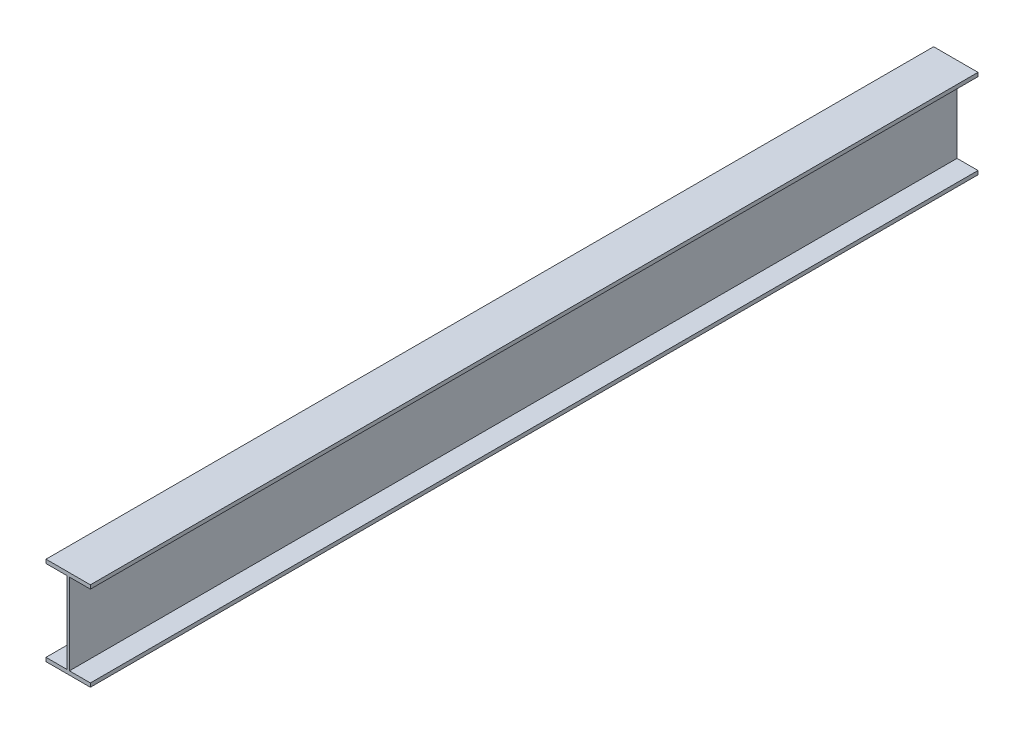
ISO-10303-21;
HEADER;
FILE_DESCRIPTION(('STEP AP214'),'2;1');
FILE_NAME('part.step','',(''),(''),'','','');
FILE_SCHEMA(('AUTOMOTIVE_DESIGN { 1 0 10303 214 1 1 1 1 }'));
ENDSEC;
DATA;
#1=APPLICATION_CONTEXT('core data for automotive mechanical design processes');
#2=APPLICATION_PROTOCOL_DEFINITION('international standard','automotive_design',2000,#1);
#3=PRODUCT_CONTEXT('',#1,'mechanical');
#4=PRODUCT('Part','Part','',(#3));
#5=PRODUCT_RELATED_PRODUCT_CATEGORY('part','',(#4));
#6=PRODUCT_DEFINITION_FORMATION('','',#4);
#7=PRODUCT_DEFINITION_CONTEXT('part definition',#1,'design');
#8=PRODUCT_DEFINITION('design','',#6,#7);
#9=PRODUCT_DEFINITION_SHAPE('','',#8);
#10=(LENGTH_UNIT() NAMED_UNIT(*) SI_UNIT(.MILLI.,.METRE.));
#11=(NAMED_UNIT(*) PLANE_ANGLE_UNIT() SI_UNIT($,.RADIAN.));
#12=(NAMED_UNIT(*) SI_UNIT($,.STERADIAN.) SOLID_ANGLE_UNIT());
#13=UNCERTAINTY_MEASURE_WITH_UNIT(LENGTH_MEASURE(1.E-05),#10,'distance_accuracy_value','');
#14=(GEOMETRIC_REPRESENTATION_CONTEXT(3) GLOBAL_UNCERTAINTY_ASSIGNED_CONTEXT((#13)) GLOBAL_UNIT_ASSIGNED_CONTEXT((#10,
#11,#12)) REPRESENTATION_CONTEXT('',''));
#15=CARTESIAN_POINT('',(0.,0.,0.));
#16=DIRECTION('',(0.,0.,1.));
#17=DIRECTION('',(1.,0.,0.));
#18=AXIS2_PLACEMENT_3D('',#15,#16,#17);
#19=CARTESIAN_POINT('',(0.,0.,2000.));
#20=DIRECTION('',(0.,0.,1.));
#21=DIRECTION('',(1.,0.,0.));
#22=AXIS2_PLACEMENT_3D('',#19,#20,#21);
#23=PLANE('',#22);
#24=DIRECTION('',(1.,0.,0.));
#25=VECTOR('',#24,1.);
#26=CARTESIAN_POINT('',(-50.,-100.,2000.));
#27=LINE('',#26,#25);
#28=CARTESIAN_POINT('',(-50.,-100.,2000.));
#29=VERTEX_POINT('',#28);
#30=CARTESIAN_POINT('',(50.,-100.,2000.));
#31=VERTEX_POINT('',#30);
#32=EDGE_CURVE('E271',#29,#31,#27,.T.);
#33=ORIENTED_EDGE('',*,*,#32,.T.);
#34=DIRECTION('',(0.,1.,0.));
#35=VECTOR('',#34,1.);
#36=CARTESIAN_POINT('',(50.,-100.,2000.));
#37=LINE('',#36,#35);
#38=CARTESIAN_POINT('',(50.,-91.5,2000.));
#39=VERTEX_POINT('',#38);
#40=EDGE_CURVE('E251',#31,#39,#37,.T.);
#41=ORIENTED_EDGE('',*,*,#40,.T.);
#42=DIRECTION('',(-1.,0.,0.));
#43=VECTOR('',#42,1.);
#44=CARTESIAN_POINT('',(50.,-91.5,2000.));
#45=LINE('',#44,#43);
#46=CARTESIAN_POINT('',(2.8,-91.5,2000.));
#47=VERTEX_POINT('',#46);
#48=EDGE_CURVE('E159',#39,#47,#45,.T.);
#49=ORIENTED_EDGE('',*,*,#48,.T.);
#50=DIRECTION('',(0.,1.,0.));
#51=VECTOR('',#50,1.);
#52=CARTESIAN_POINT('',(2.8,-91.5,2000.));
#53=LINE('',#52,#51);
#54=CARTESIAN_POINT('',(2.8,91.5,2000.));
#55=VERTEX_POINT('',#54);
#56=EDGE_CURVE('E230',#47,#55,#53,.T.);
#57=ORIENTED_EDGE('',*,*,#56,.T.);
#58=DIRECTION('',(1.,0.,0.));
#59=VECTOR('',#58,1.);
#60=CARTESIAN_POINT('',(2.8,91.5,2000.));
#61=LINE('',#60,#59);
#62=CARTESIAN_POINT('',(50.,91.5,2000.));
#63=VERTEX_POINT('',#62);
#64=EDGE_CURVE('E172',#55,#63,#61,.T.);
#65=ORIENTED_EDGE('',*,*,#64,.T.);
#66=DIRECTION('',(0.,1.,0.));
#67=VECTOR('',#66,1.);
#68=CARTESIAN_POINT('',(50.,91.5,2000.));
#69=LINE('',#68,#67);
#70=CARTESIAN_POINT('',(50.,100.,2000.));
#71=VERTEX_POINT('',#70);
#72=EDGE_CURVE('E176',#63,#71,#69,.T.);
#73=ORIENTED_EDGE('',*,*,#72,.T.);
#74=DIRECTION('',(-1.,0.,0.));
#75=VECTOR('',#74,1.);
#76=CARTESIAN_POINT('',(50.,100.,2000.));
#77=LINE('',#76,#75);
#78=CARTESIAN_POINT('',(-50.,100.,2000.));
#79=VERTEX_POINT('',#78);
#80=EDGE_CURVE('E185',#71,#79,#77,.T.);
#81=ORIENTED_EDGE('',*,*,#80,.T.);
#82=DIRECTION('',(0.,-1.,0.));
#83=VECTOR('',#82,1.);
#84=CARTESIAN_POINT('',(-50.,100.,2000.));
#85=LINE('',#84,#83);
#86=CARTESIAN_POINT('',(-50.,91.5,2000.));
#87=VERTEX_POINT('',#86);
#88=EDGE_CURVE('E197',#79,#87,#85,.T.);
#89=ORIENTED_EDGE('',*,*,#88,.T.);
#90=DIRECTION('',(1.,0.,0.));
#91=VECTOR('',#90,1.);
#92=CARTESIAN_POINT('',(-50.,91.5,2000.));
#93=LINE('',#92,#91);
#94=CARTESIAN_POINT('',(-2.8,91.5,2000.));
#95=VERTEX_POINT('',#94);
#96=EDGE_CURVE('E139',#87,#95,#93,.T.);
#97=ORIENTED_EDGE('',*,*,#96,.T.);
#98=DIRECTION('',(0.,-1.,0.));
#99=VECTOR('',#98,1.);
#100=CARTESIAN_POINT('',(-2.8,91.5,2000.));
#101=LINE('',#100,#99);
#102=CARTESIAN_POINT('',(-2.8,-91.5,2000.));
#103=VERTEX_POINT('',#102);
#104=EDGE_CURVE('E124',#95,#103,#101,.T.);
#105=ORIENTED_EDGE('',*,*,#104,.T.);
#106=DIRECTION('',(-1.,0.,0.));
#107=VECTOR('',#106,1.);
#108=CARTESIAN_POINT('',(-2.8,-91.5,2000.));
#109=LINE('',#108,#107);
#110=CARTESIAN_POINT('',(-50.,-91.5,2000.));
#111=VERTEX_POINT('',#110);
#112=EDGE_CURVE('E129',#103,#111,#109,.T.);
#113=ORIENTED_EDGE('',*,*,#112,.T.);
#114=DIRECTION('',(0.,-1.,0.));
#115=VECTOR('',#114,1.);
#116=CARTESIAN_POINT('',(-50.,-91.5,2000.));
#117=LINE('',#116,#115);
#118=EDGE_CURVE('E10',#111,#29,#117,.T.);
#119=ORIENTED_EDGE('',*,*,#118,.T.);
#120=EDGE_LOOP('',(#33,#41,#49,#57,#65,#73,#81,#89,#97,#105,#113,#119));
#121=FACE_BOUND('',#120,.T.);
#122=ADVANCED_FACE('F16',(#121),#23,.T.);
#123=CARTESIAN_POINT('',(0.,0.,0.));
#124=DIRECTION('',(0.,0.,1.));
#125=DIRECTION('',(1.,0.,0.));
#126=AXIS2_PLACEMENT_3D('',#123,#124,#125);
#127=PLANE('',#126);
#128=DIRECTION('',(0.,-1.,0.));
#129=VECTOR('',#128,1.);
#130=CARTESIAN_POINT('',(-50.,-91.5,0.));
#131=LINE('',#130,#129);
#132=CARTESIAN_POINT('',(-50.,-91.5,0.));
#133=VERTEX_POINT('',#132);
#134=CARTESIAN_POINT('',(-50.,-100.,0.));
#135=VERTEX_POINT('',#134);
#136=EDGE_CURVE('E19',#133,#135,#131,.T.);
#137=ORIENTED_EDGE('',*,*,#136,.F.);
#138=DIRECTION('',(-1.,0.,0.));
#139=VECTOR('',#138,1.);
#140=CARTESIAN_POINT('',(-2.8,-91.5,0.));
#141=LINE('',#140,#139);
#142=CARTESIAN_POINT('',(-2.8,-91.5,0.));
#143=VERTEX_POINT('',#142);
#144=EDGE_CURVE('E114',#143,#133,#141,.T.);
#145=ORIENTED_EDGE('',*,*,#144,.F.);
#146=DIRECTION('',(0.,-1.,0.));
#147=VECTOR('',#146,1.);
#148=CARTESIAN_POINT('',(-2.8,91.5,0.));
#149=LINE('',#148,#147);
#150=CARTESIAN_POINT('',(-2.8,91.5,0.));
#151=VERTEX_POINT('',#150);
#152=EDGE_CURVE('E118',#151,#143,#149,.T.);
#153=ORIENTED_EDGE('',*,*,#152,.F.);
#154=DIRECTION('',(1.,0.,0.));
#155=VECTOR('',#154,1.);
#156=CARTESIAN_POINT('',(-50.,91.5,0.));
#157=LINE('',#156,#155);
#158=CARTESIAN_POINT('',(-50.,91.5,0.));
#159=VERTEX_POINT('',#158);
#160=EDGE_CURVE('E201',#159,#151,#157,.T.);
#161=ORIENTED_EDGE('',*,*,#160,.F.);
#162=DIRECTION('',(0.,-1.,0.));
#163=VECTOR('',#162,1.);
#164=CARTESIAN_POINT('',(-50.,100.,0.));
#165=LINE('',#164,#163);
#166=CARTESIAN_POINT('',(-50.,100.,0.));
#167=VERTEX_POINT('',#166);
#168=EDGE_CURVE('E189',#167,#159,#165,.T.);
#169=ORIENTED_EDGE('',*,*,#168,.F.);
#170=DIRECTION('',(-1.,0.,0.));
#171=VECTOR('',#170,1.);
#172=CARTESIAN_POINT('',(50.,100.,0.));
#173=LINE('',#172,#171);
#174=CARTESIAN_POINT('',(50.,100.,0.));
#175=VERTEX_POINT('',#174);
#176=EDGE_CURVE('E177',#175,#167,#173,.T.);
#177=ORIENTED_EDGE('',*,*,#176,.F.);
#178=DIRECTION('',(0.,1.,0.));
#179=VECTOR('',#178,1.);
#180=CARTESIAN_POINT('',(50.,91.5,0.));
#181=LINE('',#180,#179);
#182=CARTESIAN_POINT('',(50.,91.5,0.));
#183=VERTEX_POINT('',#182);
#184=EDGE_CURVE('E167',#183,#175,#181,.T.);
#185=ORIENTED_EDGE('',*,*,#184,.F.);
#186=DIRECTION('',(1.,0.,0.));
#187=VECTOR('',#186,1.);
#188=CARTESIAN_POINT('',(2.8,91.5,0.));
#189=LINE('',#188,#187);
#190=CARTESIAN_POINT('',(2.8,91.5,0.));
#191=VERTEX_POINT('',#190);
#192=EDGE_CURVE('E225',#191,#183,#189,.T.);
#193=ORIENTED_EDGE('',*,*,#192,.F.);
#194=DIRECTION('',(0.,1.,0.));
#195=VECTOR('',#194,1.);
#196=CARTESIAN_POINT('',(2.8,-91.5,0.));
#197=LINE('',#196,#195);
#198=CARTESIAN_POINT('',(2.8,-91.5,0.));
#199=VERTEX_POINT('',#198);
#200=EDGE_CURVE('E162',#199,#191,#197,.T.);
#201=ORIENTED_EDGE('',*,*,#200,.F.);
#202=DIRECTION('',(-1.,0.,0.));
#203=VECTOR('',#202,1.);
#204=CARTESIAN_POINT('',(50.,-91.5,0.));
#205=LINE('',#204,#203);
#206=CARTESIAN_POINT('',(50.,-91.5,0.));
#207=VERTEX_POINT('',#206);
#208=EDGE_CURVE('E243',#207,#199,#205,.T.);
#209=ORIENTED_EDGE('',*,*,#208,.F.);
#210=DIRECTION('',(0.,1.,0.));
#211=VECTOR('',#210,1.);
#212=CARTESIAN_POINT('',(50.,-100.,0.));
#213=LINE('',#212,#211);
#214=CARTESIAN_POINT('',(50.,-100.,0.));
#215=VERTEX_POINT('',#214);
#216=EDGE_CURVE('E262',#215,#207,#213,.T.);
#217=ORIENTED_EDGE('',*,*,#216,.F.);
#218=DIRECTION('',(1.,0.,0.));
#219=VECTOR('',#218,1.);
#220=CARTESIAN_POINT('',(-50.,-100.,0.));
#221=LINE('',#220,#219);
#222=EDGE_CURVE('E280',#135,#215,#221,.T.);
#223=ORIENTED_EDGE('',*,*,#222,.F.);
#224=EDGE_LOOP('',(#137,#145,#153,#161,#169,#177,#185,#193,#201,#209,#217,#223));
#225=FACE_BOUND('',#224,.T.);
#226=ADVANCED_FACE('F116',(#225),#127,.F.);
#227=CARTESIAN_POINT('',(-50.,-91.5,0.));
#228=DIRECTION('',(1.,0.,0.));
#229=DIRECTION('',(0.,1.,0.));
#230=AXIS2_PLACEMENT_3D('',#227,#228,#229);
#231=PLANE('',#230);
#232=ORIENTED_EDGE('',*,*,#136,.T.);
#233=DIRECTION('',(0.,0.,1.));
#234=VECTOR('',#233,1.);
#235=CARTESIAN_POINT('',(-50.,-100.,0.));
#236=LINE('',#235,#234);
#237=EDGE_CURVE('E268',#135,#29,#236,.T.);
#238=ORIENTED_EDGE('',*,*,#237,.T.);
#239=ORIENTED_EDGE('',*,*,#118,.F.);
#240=DIRECTION('',(0.,0.,1.));
#241=VECTOR('',#240,1.);
#242=CARTESIAN_POINT('',(-50.,-91.5,0.));
#243=LINE('',#242,#241);
#244=EDGE_CURVE('E123',#133,#111,#243,.T.);
#245=ORIENTED_EDGE('',*,*,#244,.F.);
#246=EDGE_LOOP('',(#232,#238,#239,#245));
#247=FACE_BOUND('',#246,.T.);
#248=ADVANCED_FACE('F309',(#247),#231,.F.);
#249=CARTESIAN_POINT('',(-2.8,-91.5,0.));
#250=DIRECTION('',(0.,-1.,0.));
#251=DIRECTION('',(0.,0.,-1.));
#252=AXIS2_PLACEMENT_3D('',#249,#250,#251);
#253=PLANE('',#252);
#254=ORIENTED_EDGE('',*,*,#144,.T.);
#255=ORIENTED_EDGE('',*,*,#244,.T.);
#256=ORIENTED_EDGE('',*,*,#112,.F.);
#257=DIRECTION('',(0.,0.,1.));
#258=VECTOR('',#257,1.);
#259=CARTESIAN_POINT('',(-2.8,-91.5,0.));
#260=LINE('',#259,#258);
#261=EDGE_CURVE('E127',#143,#103,#260,.T.);
#262=ORIENTED_EDGE('',*,*,#261,.F.);
#263=EDGE_LOOP('',(#254,#255,#256,#262));
#264=FACE_BOUND('',#263,.T.);
#265=ADVANCED_FACE('F128',(#264),#253,.F.);
#266=CARTESIAN_POINT('',(-2.8,91.5,0.));
#267=DIRECTION('',(1.,0.,0.));
#268=DIRECTION('',(0.,1.,0.));
#269=AXIS2_PLACEMENT_3D('',#266,#267,#268);
#270=PLANE('',#269);
#271=ORIENTED_EDGE('',*,*,#152,.T.);
#272=ORIENTED_EDGE('',*,*,#261,.T.);
#273=ORIENTED_EDGE('',*,*,#104,.F.);
#274=DIRECTION('',(0.,0.,1.));
#275=VECTOR('',#274,1.);
#276=CARTESIAN_POINT('',(-2.8,91.5,0.));
#277=LINE('',#276,#275);
#278=EDGE_CURVE('E136',#151,#95,#277,.T.);
#279=ORIENTED_EDGE('',*,*,#278,.F.);
#280=EDGE_LOOP('',(#271,#272,#273,#279));
#281=FACE_BOUND('',#280,.T.);
#282=ADVANCED_FACE('F134',(#281),#270,.F.);
#283=CARTESIAN_POINT('',(-50.,91.5,0.));
#284=DIRECTION('',(0.,1.,0.));
#285=DIRECTION('',(1.,0.,0.));
#286=AXIS2_PLACEMENT_3D('',#283,#284,#285);
#287=PLANE('',#286);
#288=ORIENTED_EDGE('',*,*,#160,.T.);
#289=ORIENTED_EDGE('',*,*,#278,.T.);
#290=ORIENTED_EDGE('',*,*,#96,.F.);
#291=DIRECTION('',(0.,0.,1.));
#292=VECTOR('',#291,1.);
#293=CARTESIAN_POINT('',(-50.,91.5,0.));
#294=LINE('',#293,#292);
#295=EDGE_CURVE('E193',#159,#87,#294,.T.);
#296=ORIENTED_EDGE('',*,*,#295,.F.);
#297=EDGE_LOOP('',(#288,#289,#290,#296));
#298=FACE_BOUND('',#297,.T.);
#299=ADVANCED_FACE('F206',(#298),#287,.F.);
#300=CARTESIAN_POINT('',(-50.,100.,0.));
#301=DIRECTION('',(1.,0.,0.));
#302=DIRECTION('',(0.,1.,0.));
#303=AXIS2_PLACEMENT_3D('',#300,#301,#302);
#304=PLANE('',#303);
#305=ORIENTED_EDGE('',*,*,#168,.T.);
#306=ORIENTED_EDGE('',*,*,#295,.T.);
#307=ORIENTED_EDGE('',*,*,#88,.F.);
#308=DIRECTION('',(0.,0.,1.));
#309=VECTOR('',#308,1.);
#310=CARTESIAN_POINT('',(-50.,100.,0.));
#311=LINE('',#310,#309);
#312=EDGE_CURVE('E181',#167,#79,#311,.T.);
#313=ORIENTED_EDGE('',*,*,#312,.F.);
#314=EDGE_LOOP('',(#305,#306,#307,#313));
#315=FACE_BOUND('',#314,.T.);
#316=ADVANCED_FACE('F212',(#315),#304,.F.);
#317=CARTESIAN_POINT('',(50.,100.,0.));
#318=DIRECTION('',(0.,-1.,0.));
#319=DIRECTION('',(0.,0.,-1.));
#320=AXIS2_PLACEMENT_3D('',#317,#318,#319);
#321=PLANE('',#320);
#322=ORIENTED_EDGE('',*,*,#176,.T.);
#323=ORIENTED_EDGE('',*,*,#312,.T.);
#324=ORIENTED_EDGE('',*,*,#80,.F.);
#325=DIRECTION('',(0.,0.,1.));
#326=VECTOR('',#325,1.);
#327=CARTESIAN_POINT('',(50.,100.,0.));
#328=LINE('',#327,#326);
#329=EDGE_CURVE('E171',#175,#71,#328,.T.);
#330=ORIENTED_EDGE('',*,*,#329,.F.);
#331=EDGE_LOOP('',(#322,#323,#324,#330));
#332=FACE_BOUND('',#331,.T.);
#333=ADVANCED_FACE('F214',(#332),#321,.F.);
#334=CARTESIAN_POINT('',(50.,91.5,0.));
#335=DIRECTION('',(-1.,0.,0.));
#336=DIRECTION('',(0.,0.,1.));
#337=AXIS2_PLACEMENT_3D('',#334,#335,#336);
#338=PLANE('',#337);
#339=ORIENTED_EDGE('',*,*,#184,.T.);
#340=ORIENTED_EDGE('',*,*,#329,.T.);
#341=ORIENTED_EDGE('',*,*,#72,.F.);
#342=DIRECTION('',(0.,0.,1.));
#343=VECTOR('',#342,1.);
#344=CARTESIAN_POINT('',(50.,91.5,0.));
#345=LINE('',#344,#343);
#346=EDGE_CURVE('E223',#183,#63,#345,.T.);
#347=ORIENTED_EDGE('',*,*,#346,.F.);
#348=EDGE_LOOP('',(#339,#340,#341,#347));
#349=FACE_BOUND('',#348,.T.);
#350=ADVANCED_FACE('F221',(#349),#338,.F.);
#351=CARTESIAN_POINT('',(2.8,91.5,0.));
#352=DIRECTION('',(0.,1.,0.));
#353=DIRECTION('',(1.,0.,0.));
#354=AXIS2_PLACEMENT_3D('',#351,#352,#353);
#355=PLANE('',#354);
#356=ORIENTED_EDGE('',*,*,#192,.T.);
#357=ORIENTED_EDGE('',*,*,#346,.T.);
#358=ORIENTED_EDGE('',*,*,#64,.F.);
#359=DIRECTION('',(0.,0.,1.));
#360=VECTOR('',#359,1.);
#361=CARTESIAN_POINT('',(2.8,91.5,0.));
#362=LINE('',#361,#360);
#363=EDGE_CURVE('E166',#191,#55,#362,.T.);
#364=ORIENTED_EDGE('',*,*,#363,.F.);
#365=EDGE_LOOP('',(#356,#357,#358,#364));
#366=FACE_BOUND('',#365,.T.);
#367=ADVANCED_FACE('F233',(#366),#355,.F.);
#368=CARTESIAN_POINT('',(2.8,-91.5,0.));
#369=DIRECTION('',(-1.,0.,0.));
#370=DIRECTION('',(0.,0.,1.));
#371=AXIS2_PLACEMENT_3D('',#368,#369,#370);
#372=PLANE('',#371);
#373=ORIENTED_EDGE('',*,*,#200,.T.);
#374=ORIENTED_EDGE('',*,*,#363,.T.);
#375=ORIENTED_EDGE('',*,*,#56,.F.);
#376=DIRECTION('',(0.,0.,1.));
#377=VECTOR('',#376,1.);
#378=CARTESIAN_POINT('',(2.8,-91.5,0.));
#379=LINE('',#378,#377);
#380=EDGE_CURVE('E157',#199,#47,#379,.T.);
#381=ORIENTED_EDGE('',*,*,#380,.F.);
#382=EDGE_LOOP('',(#373,#374,#375,#381));
#383=FACE_BOUND('',#382,.T.);
#384=ADVANCED_FACE('F239',(#383),#372,.F.);
#385=CARTESIAN_POINT('',(50.,-91.5,0.));
#386=DIRECTION('',(0.,-1.,0.));
#387=DIRECTION('',(0.,0.,-1.));
#388=AXIS2_PLACEMENT_3D('',#385,#386,#387);
#389=PLANE('',#388);
#390=ORIENTED_EDGE('',*,*,#208,.T.);
#391=ORIENTED_EDGE('',*,*,#380,.T.);
#392=ORIENTED_EDGE('',*,*,#48,.F.);
#393=DIRECTION('',(0.,0.,1.));
#394=VECTOR('',#393,1.);
#395=CARTESIAN_POINT('',(50.,-91.5,0.));
#396=LINE('',#395,#394);
#397=EDGE_CURVE('E247',#207,#39,#396,.T.);
#398=ORIENTED_EDGE('',*,*,#397,.F.);
#399=EDGE_LOOP('',(#390,#391,#392,#398));
#400=FACE_BOUND('',#399,.T.);
#401=ADVANCED_FACE('F245',(#400),#389,.F.);
#402=CARTESIAN_POINT('',(50.,-100.,0.));
#403=DIRECTION('',(-1.,0.,0.));
#404=DIRECTION('',(0.,0.,1.));
#405=AXIS2_PLACEMENT_3D('',#402,#403,#404);
#406=PLANE('',#405);
#407=ORIENTED_EDGE('',*,*,#216,.T.);
#408=ORIENTED_EDGE('',*,*,#397,.T.);
#409=ORIENTED_EDGE('',*,*,#40,.F.);
#410=DIRECTION('',(0.,0.,1.));
#411=VECTOR('',#410,1.);
#412=CARTESIAN_POINT('',(50.,-100.,0.));
#413=LINE('',#412,#411);
#414=EDGE_CURVE('E275',#215,#31,#413,.T.);
#415=ORIENTED_EDGE('',*,*,#414,.F.);
#416=EDGE_LOOP('',(#407,#408,#409,#415));
#417=FACE_BOUND('',#416,.T.);
#418=ADVANCED_FACE('F292',(#417),#406,.F.);
#419=CARTESIAN_POINT('',(-50.,-100.,0.));
#420=DIRECTION('',(0.,1.,0.));
#421=DIRECTION('',(1.,0.,0.));
#422=AXIS2_PLACEMENT_3D('',#419,#420,#421);
#423=PLANE('',#422);
#424=ORIENTED_EDGE('',*,*,#222,.T.);
#425=ORIENTED_EDGE('',*,*,#414,.T.);
#426=ORIENTED_EDGE('',*,*,#32,.F.);
#427=ORIENTED_EDGE('',*,*,#237,.F.);
#428=EDGE_LOOP('',(#424,#425,#426,#427));
#429=FACE_BOUND('',#428,.T.);
#430=ADVANCED_FACE('F311',(#429),#423,.F.);
#431=CLOSED_SHELL('',(#122,#226,#248,#265,#282,#299,#316,#333,#350,#367,#384,#401,#418,#430));
#432=MANIFOLD_SOLID_BREP('B1',#431);
#433=ADVANCED_BREP_SHAPE_REPRESENTATION('',(#18,#432),#14);
#434=SHAPE_DEFINITION_REPRESENTATION(#9,#433);
ENDSEC;
END-ISO-10303-21;
